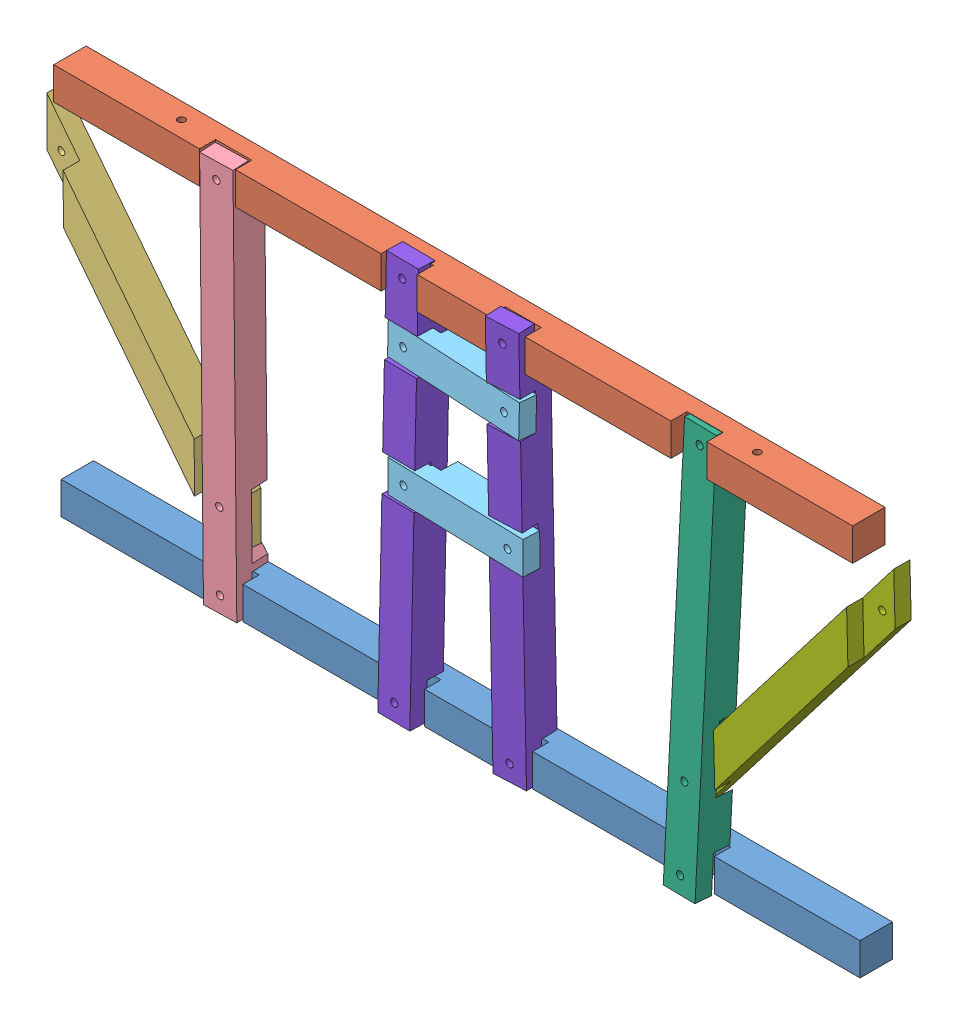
SolidWorks assembly Assemblage_D.SLDASM, configuration Défaut (file format 3400). Lengths in mm.
Overall size (248.9 110.64 14.97).
10 component instances, 8 part files, 0 mates.
Components (placement in the parent):
- largeur_B-1: largeur_B.SLDPRT [Défaut] at (-110.4192 -41.287 -4.5) size (222 9 9)
- largeur_H-1: largeur_H.SLDPRT [Défaut] at (-110.2296 59.7216 -2.25) size (222 9 9)
- decharge_G1-1: decharge_G1.SLDPRT [Défaut] at (-54.9708 -22.0968 -2.3228) x (-0.610337 0.79212 0.005809) z (-0.033871 -0.033423 0.998867) size (100 9 9)
- montant_14-31-1: montant_14-31.SLDPRT [Default] at (-169.6587 2.0951 9.8084) x (-0.005146 -0.999876 -0.014866) z (-0.030782 0.015017 -0.999413) size (110 9 9)
- traverse_T4-2: traverse_T4.SLDPRT [Défaut] at (-18.1397 19.9619 6.0202) x (0.999309 0.008967 0.036082) z (0.036126 -0.004839 -0.999336) size (39 9 9)
- traverse_T4-3: traverse_T4.SLDPRT [Défaut] at (-18.6517 52.7693 5.3559) x (0.997929 0.009791 0.063574) z (0.063851 -0.031225 -0.997471) size (39 9 9)
- montant_17-34-1: montant_17-34.SLDPRT [Default] at (-38.5955 1.5525 5.3535) x (-0.001177 -0.998602 0.052847) z (0.019352 -0.05286 -0.998414) size (110 9 9)
- decharge_D1-1: decharge_D1.SLDPRT [Défaut] at (118.2804 59.1288 -2.6474) x (-0.608607 -0.793431 0.00801) z (0.005398 0.005954 0.999968) size (100 9 9)
- montant_15-16-1: montant_15-16.SLDPRT [Default] at (-89.5059 0.5123 10.4578) x (0.010351 -0.999905 -0.009056) z (-0.036453 0.008673 -0.999298) size (110 9 9)
- montant_15-16-2: montant_15-16.SLDPRT [Default] at (-119.6409 1.7782 6.0537) x (-0.00025 -0.999764 0.021717) z (0.009144 -0.021718 -0.999722) size (110 9 9)
